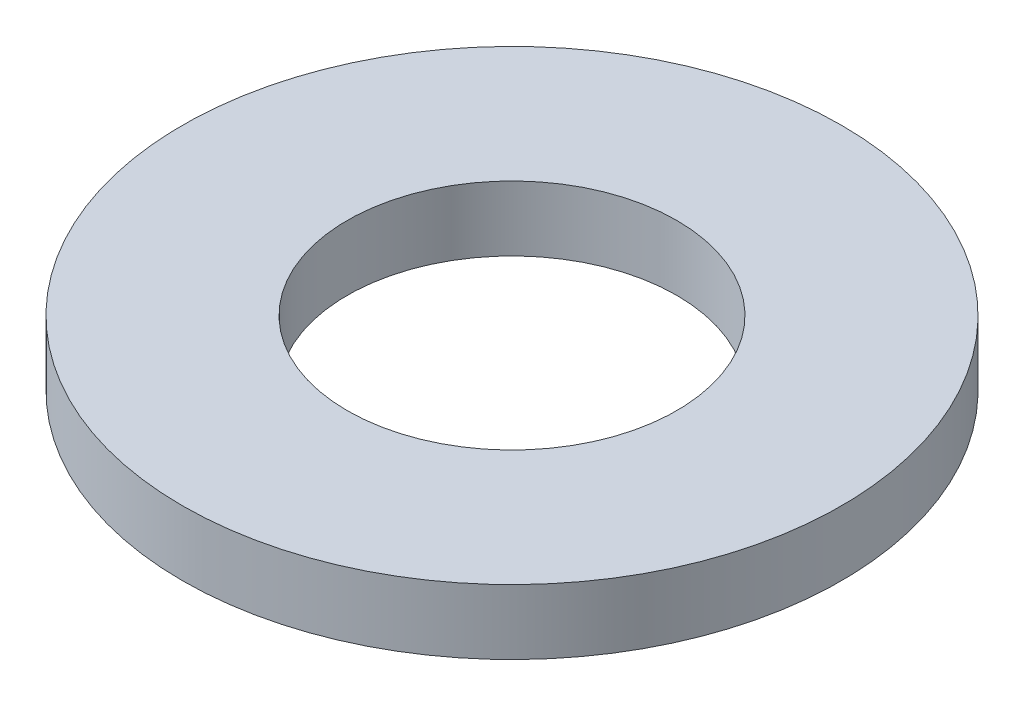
from build123d import *

# Parameters (mm, degrees)
SKETCH1_R           = 10.3124
BOSS_EXTRUDE1_DEPTH = 2.032
SKETCH5_R           = 5.1562
CUT_EXTRUDE1_DEPTH  = 15.724816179


with BuildPart() as part:
    # Sketch1 → Boss-Extrude1 (new body)
    with BuildSketch(Plane(origin=(0, 0, 0), x_dir=(1, 0, 0), z_dir=(0, 1, 0))):
        with Locations(Location((0, 0, 0), (0, 0, 270))):
            Circle(SKETCH1_R)
    extrude(amount=BOSS_EXTRUDE1_DEPTH)

    # Sketch5 → Cut-Extrude1 (cut, through all)
    with BuildSketch(Plane(origin=(0, 2.032, 0), x_dir=(-1, 0, 0), z_dir=(0, 1, 0))):
        with Locations(Location((0, 0, 0), (0, 0, 90))):
            Circle(SKETCH5_R)
    extrude(amount=-CUT_EXTRUDE1_DEPTH, mode=Mode.SUBTRACT)


solid = part.part
